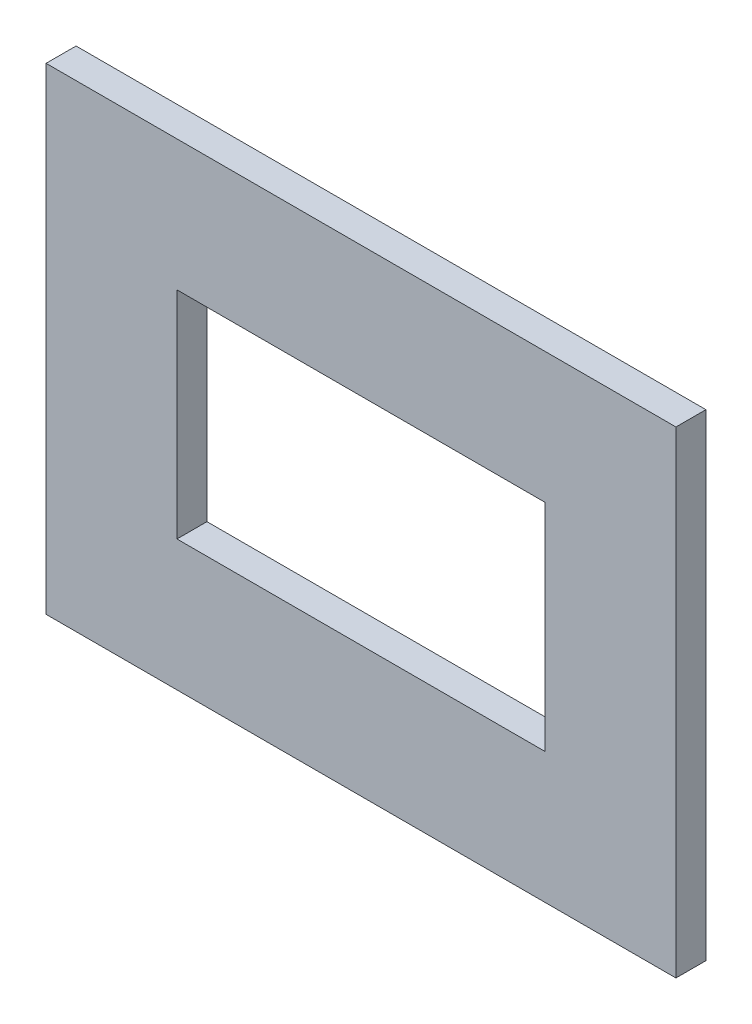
from build123d import *

# Parameters (mm, degrees)
SKETCH1_W           = 1407.485243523
SKETCH1_H           = 1128.959139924
SKETCH1_W_2         = 184.15
SKETCH1_H_2         = 107.95
BOSS_EXTRUDE1_DEPTH = 15
SKETCH2_W           = 1634.850849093
SKETCH2_H           = 1414.029762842
SKETCH2_W_2         = 382.055983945
SKETCH2_H_2         = 461.196152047
CUT_EXTRUDE1_DEPTH  = 1080.206832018
SKETCH3_W           = 382.055983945
SKETCH3_H           = 461.196152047
SKETCH3_W_2         = 315.123469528
SKETCH3_H_2         = 238.751439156
CUT_EXTRUDE2_DEPTH  = 355.870393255


with BuildPart() as part:
    # Sketch1 → Boss-Extrude1 (new body)
    with BuildSketch(Plane.XY):
        with Locations((64.619518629, -193.202426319)):
            Rectangle(SKETCH1_W, SKETCH1_H)
        Rectangle(SKETCH1_W_2, SKETCH1_H_2, mode=Mode.SUBTRACT)
    extrude(amount=BOSS_EXTRUDE1_DEPTH)

    # Sketch2 → Cut-Extrude1 (cut, through all)
    with BuildSketch(Plane(origin=(0, 0, 0), x_dir=(-1, 0, 0), z_dir=(0, 0, -1))):
        with Locations((-17.147082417, -252.403097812)):
            Rectangle(SKETCH2_W, SKETCH2_H)
        with Locations((1.955728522, -66.833058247)):
            Rectangle(SKETCH2_W_2, SKETCH2_H_2, mode=Mode.SUBTRACT)
    extrude(amount=-CUT_EXTRUDE1_DEPTH, mode=Mode.SUBTRACT)

    # Sketch3 → Cut-Extrude2 (cut, through all)
    with BuildSketch(Plane(origin=(0, 0, 0), x_dir=(-1, 0, 0), z_dir=(0, 0, -1))):
        with Locations((1.955728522, -66.833058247)):
            Rectangle(SKETCH3_W, SKETCH3_H)
        Rectangle(SKETCH3_W_2, SKETCH3_H_2, mode=Mode.SUBTRACT)
    extrude(amount=-CUT_EXTRUDE2_DEPTH, mode=Mode.SUBTRACT)


solid = part.part
